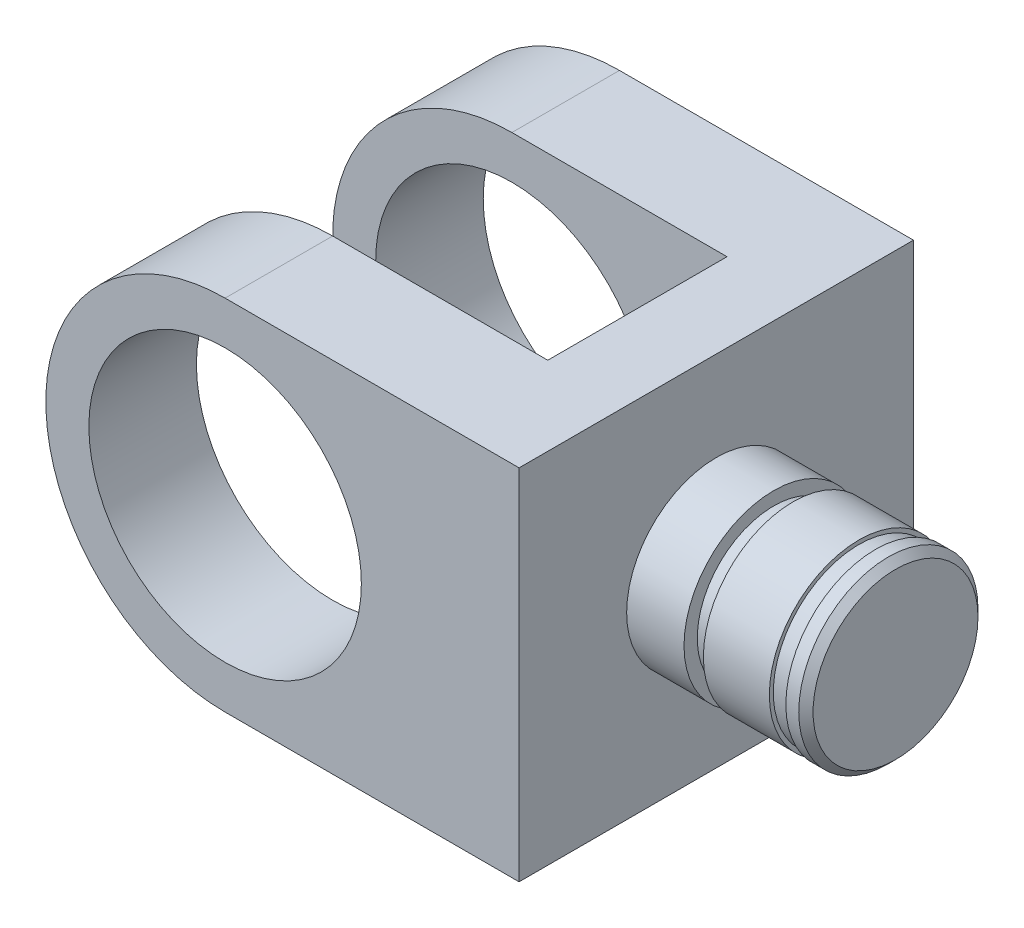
from build123d import *

# Parameters (mm, degrees)
ESQUISSE2_R             = 19
EXTRUSION1_DEPTH        = 27.5
ESQUISSE3_W             = 58.140757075
ESQUISSE3_H             = 68.523827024
ENL_V_MAT_EXTRU_1_DEPTH = 12.5


with BuildPart() as part:
    # Esquisse1 → R_volution1 (revolve)
    with BuildSketch(Plane.XY, mode=Mode.PRIVATE) as r_volution1_sk:
        Polygon((-15.352443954, 22.806994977), (-7.352443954, 22.806994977), (-7.352443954, 20.956994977), (-4.652443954, 20.956994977), (-4.652443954, 22.806994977), (4.547556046, 22.806994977), (4.547556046, 22.256994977), (6.847556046, 22.256994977), (6.847556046, 22.806994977), (8.647556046, 22.806994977), (9.647556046, 21.806994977), (9.647556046, 10.306994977), (-15.352443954, 10.306994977), align=None)
    revolve(r_volution1_sk.sketch.rotate(Axis((21.109518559, 10.306994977, 0), (-1, 0, 0)), 90), axis=Axis((21.109518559, 10.306994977, 0), (-1, 0, 0)))

    # Esquisse2 → Extrusion1 (add, symmetric)
    with BuildSketch(Plane.XY):
        with BuildLine():
            Line((-56.352443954, 35.306994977), (-15.352443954, 35.306994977))
            Line((-15.352443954, 35.306994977), (-15.352443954, -14.693005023))
            Line((-15.352443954, -14.693005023), (-56.352443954, -14.693005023))
            ThreePointArc((-56.352443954, -14.693005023), (-81.352443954, 10.306994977), (-56.352443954, 35.306994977))
        make_face()
        with Locations((-56.352443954, 10.306994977)):
            Circle(ESQUISSE2_R, mode=Mode.SUBTRACT)
    extrude(amount=EXTRUSION1_DEPTH, both=True)

    # Esquisse3 → Enl_v. mat.-Extru.1 (cut, symmetric)
    with BuildSketch(Plane.XY):
        with Locations((-55.422822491, 7.940218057)):
            Rectangle(ESQUISSE3_W, ESQUISSE3_H)
    extrude(amount=ENL_V_MAT_EXTRU_1_DEPTH, both=True, mode=Mode.SUBTRACT)


solid = part.part
